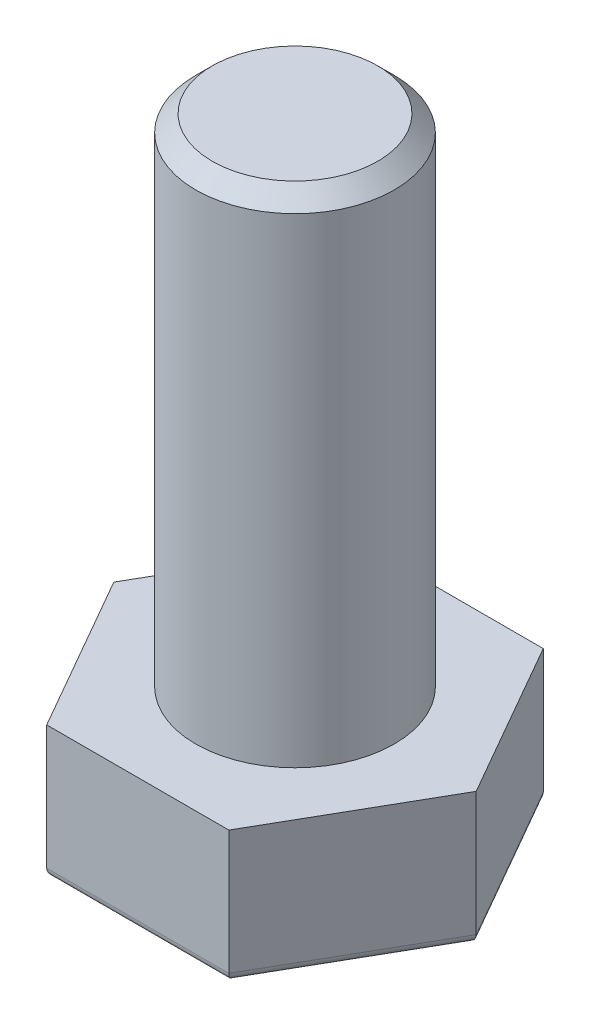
ISO-10303-21;
HEADER;
FILE_DESCRIPTION(('STEP AP214'),'2;1');
FILE_NAME('part.step','',(''),(''),'','','');
FILE_SCHEMA(('AUTOMOTIVE_DESIGN { 1 0 10303 214 1 1 1 1 }'));
ENDSEC;
DATA;
#1=APPLICATION_CONTEXT('core data for automotive mechanical design processes');
#2=APPLICATION_PROTOCOL_DEFINITION('international standard','automotive_design',2000,#1);
#3=PRODUCT_CONTEXT('',#1,'mechanical');
#4=PRODUCT('Part','Part','',(#3));
#5=PRODUCT_RELATED_PRODUCT_CATEGORY('part','',(#4));
#6=PRODUCT_DEFINITION_FORMATION('','',#4);
#7=PRODUCT_DEFINITION_CONTEXT('part definition',#1,'design');
#8=PRODUCT_DEFINITION('design','',#6,#7);
#9=PRODUCT_DEFINITION_SHAPE('','',#8);
#10=(LENGTH_UNIT() NAMED_UNIT(*) SI_UNIT(.MILLI.,.METRE.));
#11=(NAMED_UNIT(*) PLANE_ANGLE_UNIT() SI_UNIT($,.RADIAN.));
#12=(NAMED_UNIT(*) SI_UNIT($,.STERADIAN.) SOLID_ANGLE_UNIT());
#13=UNCERTAINTY_MEASURE_WITH_UNIT(LENGTH_MEASURE(1.E-05),#10,'distance_accuracy_value','');
#14=(GEOMETRIC_REPRESENTATION_CONTEXT(3) GLOBAL_UNCERTAINTY_ASSIGNED_CONTEXT((#13)) GLOBAL_UNIT_ASSIGNED_CONTEXT((#10,
#11,#12)) REPRESENTATION_CONTEXT('',''));
#15=CARTESIAN_POINT('',(0.,0.,0.));
#16=DIRECTION('',(0.,0.,1.));
#17=DIRECTION('',(1.,0.,0.));
#18=AXIS2_PLACEMENT_3D('',#15,#16,#17);
#19=CARTESIAN_POINT('',(5.50458908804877,8.00000000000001,9.4999999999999));
#20=DIRECTION('',(0.,1.,0.));
#21=DIRECTION('',(0.,0.,1.00000000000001));
#22=AXIS2_PLACEMENT_3D('',#19,#20,#21);
#23=PLANE('',#22);
#24=DIRECTION('',(1.00000000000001,0.,0.));
#25=VECTOR('',#24,1.);
#26=CARTESIAN_POINT('',(-5.50458908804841,8.00000000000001,9.4999999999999));
#27=LINE('',#26,#25);
#28=CARTESIAN_POINT('',(-5.50458908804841,8.00000000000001,9.4999999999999));
#29=VERTEX_POINT('',#28);
#30=CARTESIAN_POINT('',(5.50458908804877,8.00000000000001,9.4999999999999));
#31=VERTEX_POINT('',#30);
#32=EDGE_CURVE('E111',#29,#31,#27,.T.);
#33=ORIENTED_EDGE('',*,*,#32,.T.);
#34=DIRECTION('',(0.497297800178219,0.,-0.867579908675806));
#35=VECTOR('',#34,1.);
#36=CARTESIAN_POINT('',(5.50458908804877,8.00000000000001,9.4999999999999));
#37=LINE('',#36,#35);
#38=CARTESIAN_POINT('',(10.9500000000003,8.00000000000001,-1.66533453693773E-13));
#39=VERTEX_POINT('',#38);
#40=EDGE_CURVE('E103',#31,#39,#37,.T.);
#41=ORIENTED_EDGE('',*,*,#40,.T.);
#42=DIRECTION('',(-0.497297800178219,0.,-0.867579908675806));
#43=VECTOR('',#42,1.);
#44=CARTESIAN_POINT('',(5.50458908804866,8.00000000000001,-9.50000000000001));
#45=LINE('',#44,#43);
#46=CARTESIAN_POINT('',(5.50458908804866,8.00000000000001,-9.50000000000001));
#47=VERTEX_POINT('',#46);
#48=EDGE_CURVE('E110',#39,#47,#45,.T.);
#49=ORIENTED_EDGE('',*,*,#48,.T.);
#50=DIRECTION('',(-1.00000000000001,0.,0.));
#51=VECTOR('',#50,1.);
#52=CARTESIAN_POINT('',(-5.50458908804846,8.00000000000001,-9.50000000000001));
#53=LINE('',#52,#51);
#54=CARTESIAN_POINT('',(-5.50458908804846,8.00000000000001,-9.50000000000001));
#55=VERTEX_POINT('',#54);
#56=EDGE_CURVE('E300',#47,#55,#53,.T.);
#57=ORIENTED_EDGE('',*,*,#56,.T.);
#58=DIRECTION('',(-0.49729780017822,0.,0.867579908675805));
#59=VECTOR('',#58,1.);
#60=CARTESIAN_POINT('',(-5.50458908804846,8.00000000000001,-9.50000000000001));
#61=LINE('',#60,#59);
#62=CARTESIAN_POINT('',(-10.95,8.00000000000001,0.));
#63=VERTEX_POINT('',#62);
#64=EDGE_CURVE('E302',#55,#63,#61,.T.);
#65=ORIENTED_EDGE('',*,*,#64,.T.);
#66=DIRECTION('',(0.497297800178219,0.,0.867579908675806));
#67=VECTOR('',#66,1.);
#68=CARTESIAN_POINT('',(-5.50458908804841,8.00000000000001,9.4999999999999));
#69=LINE('',#68,#67);
#70=EDGE_CURVE('E116',#63,#29,#69,.T.);
#71=ORIENTED_EDGE('',*,*,#70,.T.);
#72=EDGE_LOOP('',(#33,#41,#49,#57,#65,#71));
#73=FACE_BOUND('',#72,.T.);
#74=CARTESIAN_POINT('',(2.4980018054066E-13,7.99999999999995,0.));
#75=DIRECTION('',(0.,1.,0.));
#76=DIRECTION('',(0.,0.,1.00000000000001));
#77=AXIS2_PLACEMENT_3D('',#74,#75,#76);
#78=CIRCLE('',#77,6.);
#79=CARTESIAN_POINT('',(2.4980018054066E-13,7.99999999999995,6.00000000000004));
#80=VERTEX_POINT('',#79);
#81=EDGE_CURVE('E281',#80,#80,#78,.T.);
#82=ORIENTED_EDGE('',*,*,#81,.F.);
#83=EDGE_LOOP('',(#82));
#84=FACE_BOUND('',#83,.T.);
#85=ADVANCED_FACE('F32',(#73,#84),#23,.T.);
#86=CARTESIAN_POINT('',(-5.50458908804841,8.00000000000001,9.4999999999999));
#87=DIRECTION('',(0.,0.,-1.00000000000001));
#88=DIRECTION('',(-1.00000000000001,0.,0.));
#89=AXIS2_PLACEMENT_3D('',#86,#87,#88);
#90=PLANE('',#89);
#91=DIRECTION('',(0.,-1.,0.));
#92=VECTOR('',#91,1.);
#93=CARTESIAN_POINT('',(-5.50458908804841,8.00000000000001,9.4999999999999));
#94=LINE('',#93,#92);
#95=CARTESIAN_POINT('',(-5.50458908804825,0.5,9.49999999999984));
#96=VERTEX_POINT('',#95);
#97=EDGE_CURVE('E305',#29,#96,#94,.T.);
#98=ORIENTED_EDGE('',*,*,#97,.T.);
#99=DIRECTION('',(1.00000000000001,0.,0.));
#100=VECTOR('',#99,1.);
#101=CARTESIAN_POINT('',(-5.50458908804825,0.5,9.49999999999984));
#102=LINE('',#101,#100);
#103=CARTESIAN_POINT('',(5.50458908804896,0.5,9.49999999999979));
#104=VERTEX_POINT('',#103);
#105=EDGE_CURVE('E47',#96,#104,#102,.T.);
#106=ORIENTED_EDGE('',*,*,#105,.T.);
#107=DIRECTION('',(0.,-1.,0.));
#108=VECTOR('',#107,1.);
#109=CARTESIAN_POINT('',(5.50458908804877,8.00000000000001,9.4999999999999));
#110=LINE('',#109,#108);
#111=EDGE_CURVE('E106',#31,#104,#110,.T.);
#112=ORIENTED_EDGE('',*,*,#111,.F.);
#113=ORIENTED_EDGE('',*,*,#32,.F.);
#114=EDGE_LOOP('',(#98,#106,#112,#113));
#115=FACE_BOUND('',#114,.T.);
#116=ADVANCED_FACE('F34',(#115),#90,.F.);
#117=CARTESIAN_POINT('',(5.50458908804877,8.00000000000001,9.4999999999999));
#118=DIRECTION('',(-0.867579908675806,0.,-0.497297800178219));
#119=DIRECTION('',(-0.497297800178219,0.,0.867579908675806));
#120=AXIS2_PLACEMENT_3D('',#117,#118,#119);
#121=PLANE('',#120);
#122=ORIENTED_EDGE('',*,*,#111,.T.);
#123=DIRECTION('',(0.497297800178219,0.,-0.867579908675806));
#124=VECTOR('',#123,1.);
#125=CARTESIAN_POINT('',(5.50458908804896,0.5,9.49999999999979));
#126=LINE('',#125,#124);
#127=CARTESIAN_POINT('',(10.9500000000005,0.499999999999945,-1.66533453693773E-13));
#128=VERTEX_POINT('',#127);
#129=EDGE_CURVE('E54',#104,#128,#126,.T.);
#130=ORIENTED_EDGE('',*,*,#129,.T.);
#131=DIRECTION('',(0.,-1.,0.));
#132=VECTOR('',#131,1.);
#133=CARTESIAN_POINT('',(10.9500000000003,8.00000000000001,-1.66533453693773E-13));
#134=LINE('',#133,#132);
#135=EDGE_CURVE('E107',#39,#128,#134,.T.);
#136=ORIENTED_EDGE('',*,*,#135,.F.);
#137=ORIENTED_EDGE('',*,*,#40,.F.);
#138=EDGE_LOOP('',(#122,#130,#136,#137));
#139=FACE_BOUND('',#138,.T.);
#140=ADVANCED_FACE('F105',(#139),#121,.F.);
#141=CARTESIAN_POINT('',(5.50458908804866,8.00000000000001,-9.50000000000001));
#142=DIRECTION('',(-0.867579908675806,0.,0.497297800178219));
#143=DIRECTION('',(0.497297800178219,0.,0.867579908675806));
#144=AXIS2_PLACEMENT_3D('',#141,#142,#143);
#145=PLANE('',#144);
#146=ORIENTED_EDGE('',*,*,#135,.T.);
#147=DIRECTION('',(-0.497297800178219,0.,-0.867579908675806));
#148=VECTOR('',#147,1.);
#149=CARTESIAN_POINT('',(5.50458908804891,0.5,-9.50000000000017));
#150=LINE('',#149,#148);
#151=CARTESIAN_POINT('',(5.50458908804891,0.5,-9.50000000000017));
#152=VERTEX_POINT('',#151);
#153=EDGE_CURVE('E145',#128,#152,#150,.T.);
#154=ORIENTED_EDGE('',*,*,#153,.T.);
#155=DIRECTION('',(0.,-1.,0.));
#156=VECTOR('',#155,1.);
#157=CARTESIAN_POINT('',(5.50458908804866,8.00000000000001,-9.50000000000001));
#158=LINE('',#157,#156);
#159=EDGE_CURVE('E125',#47,#152,#158,.T.);
#160=ORIENTED_EDGE('',*,*,#159,.F.);
#161=ORIENTED_EDGE('',*,*,#48,.F.);
#162=EDGE_LOOP('',(#146,#154,#160,#161));
#163=FACE_BOUND('',#162,.T.);
#164=ADVANCED_FACE('F183',(#163),#145,.F.);
#165=CARTESIAN_POINT('',(-5.50458908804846,8.00000000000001,-9.50000000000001));
#166=DIRECTION('',(0.,0.,1.00000000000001));
#167=DIRECTION('',(1.00000000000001,0.,0.));
#168=AXIS2_PLACEMENT_3D('',#165,#166,#167);
#169=PLANE('',#168);
#170=ORIENTED_EDGE('',*,*,#159,.T.);
#171=DIRECTION('',(-1.00000000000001,0.,0.));
#172=VECTOR('',#171,1.);
#173=CARTESIAN_POINT('',(-5.50458908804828,0.5,-9.50000000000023));
#174=LINE('',#173,#172);
#175=CARTESIAN_POINT('',(-5.50458908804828,0.5,-9.50000000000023));
#176=VERTEX_POINT('',#175);
#177=EDGE_CURVE('E143',#152,#176,#174,.T.);
#178=ORIENTED_EDGE('',*,*,#177,.T.);
#179=DIRECTION('',(0.,-1.,0.));
#180=VECTOR('',#179,1.);
#181=CARTESIAN_POINT('',(-5.50458908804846,8.00000000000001,-9.50000000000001));
#182=LINE('',#181,#180);
#183=EDGE_CURVE('E310',#55,#176,#182,.T.);
#184=ORIENTED_EDGE('',*,*,#183,.F.);
#185=ORIENTED_EDGE('',*,*,#56,.F.);
#186=EDGE_LOOP('',(#170,#178,#184,#185));
#187=FACE_BOUND('',#186,.T.);
#188=ADVANCED_FACE('F179',(#187),#169,.F.);
#189=CARTESIAN_POINT('',(-5.50458908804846,8.00000000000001,-9.50000000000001));
#190=DIRECTION('',(0.867579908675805,0.,0.49729780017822));
#191=DIRECTION('',(0.49729780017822,0.,-0.867579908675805));
#192=AXIS2_PLACEMENT_3D('',#189,#190,#191);
#193=PLANE('',#192);
#194=ORIENTED_EDGE('',*,*,#183,.T.);
#195=DIRECTION('',(-0.49729780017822,0.,0.867579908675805));
#196=VECTOR('',#195,1.);
#197=CARTESIAN_POINT('',(-5.50458908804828,0.5,-9.50000000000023));
#198=LINE('',#197,#196);
#199=CARTESIAN_POINT('',(-10.9500000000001,0.5,0.));
#200=VERTEX_POINT('',#199);
#201=EDGE_CURVE('E141',#176,#200,#198,.T.);
#202=ORIENTED_EDGE('',*,*,#201,.T.);
#203=DIRECTION('',(0.,-1.,0.));
#204=VECTOR('',#203,1.);
#205=CARTESIAN_POINT('',(-10.95,8.00000000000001,0.));
#206=LINE('',#205,#204);
#207=EDGE_CURVE('E307',#63,#200,#206,.T.);
#208=ORIENTED_EDGE('',*,*,#207,.F.);
#209=ORIENTED_EDGE('',*,*,#64,.F.);
#210=EDGE_LOOP('',(#194,#202,#208,#209));
#211=FACE_BOUND('',#210,.T.);
#212=ADVANCED_FACE('F175',(#211),#193,.F.);
#213=CARTESIAN_POINT('',(-5.50458908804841,8.00000000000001,9.4999999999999));
#214=DIRECTION('',(0.867579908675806,0.,-0.497297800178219));
#215=DIRECTION('',(-0.497297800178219,0.,-0.867579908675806));
#216=AXIS2_PLACEMENT_3D('',#213,#214,#215);
#217=PLANE('',#216);
#218=ORIENTED_EDGE('',*,*,#207,.T.);
#219=DIRECTION('',(0.497297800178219,0.,0.867579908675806));
#220=VECTOR('',#219,1.);
#221=CARTESIAN_POINT('',(-5.50458908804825,0.5,9.49999999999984));
#222=LINE('',#221,#220);
#223=EDGE_CURVE('E120',#200,#96,#222,.T.);
#224=ORIENTED_EDGE('',*,*,#223,.T.);
#225=ORIENTED_EDGE('',*,*,#97,.F.);
#226=ORIENTED_EDGE('',*,*,#70,.F.);
#227=EDGE_LOOP('',(#218,#224,#225,#226));
#228=FACE_BOUND('',#227,.T.);
#229=ADVANCED_FACE('F172',(#228),#217,.F.);
#230=CARTESIAN_POINT('',(5.50458908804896,0.,9.49999999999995));
#231=DIRECTION('',(0.,1.,0.));
#232=DIRECTION('',(0.,0.,1.00000000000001));
#233=AXIS2_PLACEMENT_3D('',#230,#231,#232);
#234=PLANE('',#233);
#235=DIRECTION('',(1.00000000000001,0.,0.));
#236=VECTOR('',#235,1.);
#237=CARTESIAN_POINT('',(5.50458908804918,0.,8.99999999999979));
#238=LINE('',#237,#236);
#239=CARTESIAN_POINT('',(5.21487387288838,0.,8.9999999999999));
#240=VERTEX_POINT('',#239);
#241=CARTESIAN_POINT('',(-5.21487387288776,0.,9.00000000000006));
#242=VERTEX_POINT('',#241);
#243=EDGE_CURVE('E123',#240,#242,#238,.F.);
#244=ORIENTED_EDGE('',*,*,#243,.T.);
#245=DIRECTION('',(0.497297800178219,0.,0.867579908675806));
#246=VECTOR('',#245,1.);
#247=CARTESIAN_POINT('',(-2.34817320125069,0.,14.0012123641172));
#248=LINE('',#247,#246);
#249=CARTESIAN_POINT('',(-10.3736842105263,0.,-2.77555756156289E-13));
#250=VERTEX_POINT('',#249);
#251=EDGE_CURVE('E138',#242,#250,#248,.F.);
#252=ORIENTED_EDGE('',*,*,#251,.T.);
#253=DIRECTION('',(-0.49729780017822,0.,0.867579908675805));
#254=VECTOR('',#253,1.);
#255=CARTESIAN_POINT('',(-10.5456392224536,0.,0.299990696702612));
#256=LINE('',#255,#254);
#257=CARTESIAN_POINT('',(-5.21487387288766,0.,-9.00000000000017));
#258=VERTEX_POINT('',#257);
#259=EDGE_CURVE('E136',#250,#258,#256,.F.);
#260=ORIENTED_EDGE('',*,*,#259,.T.);
#261=DIRECTION('',(-1.00000000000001,0.,0.));
#262=VECTOR('',#261,1.);
#263=CARTESIAN_POINT('',(5.50458908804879,0.,-9.00000000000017));
#264=LINE('',#263,#262);
#265=CARTESIAN_POINT('',(5.21487387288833,0.,-9.00000000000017));
#266=VERTEX_POINT('',#265);
#267=EDGE_CURVE('E134',#258,#266,#264,.F.);
#268=ORIENTED_EDGE('',*,*,#267,.T.);
#269=DIRECTION('',(-0.497297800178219,0.,-0.867579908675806));
#270=VECTOR('',#269,1.);
#271=CARTESIAN_POINT('',(13.2682651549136,0.,5.04985196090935));
#272=LINE('',#271,#270);
#273=CARTESIAN_POINT('',(10.3736842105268,0.,-3.33066907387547E-13));
#274=VERTEX_POINT('',#273);
#275=EDGE_CURVE('E132',#266,#274,#272,.F.);
#276=ORIENTED_EDGE('',*,*,#275,.T.);
#277=DIRECTION('',(0.497297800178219,0.,-0.867579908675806));
#278=VECTOR('',#277,1.);
#279=CARTESIAN_POINT('',(5.070799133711,0.,9.25135109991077));
#280=LINE('',#279,#278);
#281=EDGE_CURVE('E130',#274,#240,#280,.F.);
#282=ORIENTED_EDGE('',*,*,#281,.T.);
#283=EDGE_LOOP('',(#244,#252,#260,#268,#276,#282));
#284=FACE_BOUND('',#283,.T.);
#285=ADVANCED_FACE('F170',(#284),#234,.F.);
#286=CARTESIAN_POINT('',(5.07079913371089,0.5,-9.2513510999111));
#287=DIRECTION('',(-0.497297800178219,0.,-0.867579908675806));
#288=DIRECTION('',(-0.867579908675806,0.,0.497297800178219));
#289=AXIS2_PLACEMENT_3D('',#286,#287,#288);
#290=CYLINDRICAL_SURFACE('',#289,0.5);
#291=CARTESIAN_POINT('',(10.3736842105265,0.5,0.));
#292=DIRECTION('',(0.,0.,-1.00000000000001));
#293=DIRECTION('',(1.00000000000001,0.,0.));
#294=AXIS2_PLACEMENT_3D('',#291,#292,#293);
#295=ELLIPSE('',#294,0.576315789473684,0.5);
#296=EDGE_CURVE('E294',#274,#128,#295,.F.);
#297=ORIENTED_EDGE('',*,*,#296,.F.);
#298=ORIENTED_EDGE('',*,*,#275,.F.);
#299=CARTESIAN_POINT('',(5.21487387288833,0.5,-9.00000000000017));
#300=DIRECTION('',(-0.865244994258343,0.,-0.501349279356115));
#301=DIRECTION('',(0.501349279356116,0.,-0.865244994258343));
#302=AXIS2_PLACEMENT_3D('',#299,#300,#301);
#303=ELLIPSE('',#302,0.57787101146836,0.5);
#304=EDGE_CURVE('E118',#152,#266,#303,.T.);
#305=ORIENTED_EDGE('',*,*,#304,.F.);
#306=ORIENTED_EDGE('',*,*,#153,.F.);
#307=EDGE_LOOP('',(#297,#298,#305,#306));
#308=FACE_BOUND('',#307,.T.);
#309=ADVANCED_FACE('F214',(#308),#290,.T.);
#310=CARTESIAN_POINT('',(-5.50458908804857,0.5,-9.00000000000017));
#311=DIRECTION('',(-1.00000000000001,0.,0.));
#312=DIRECTION('',(0.,0.,1.00000000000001));
#313=AXIS2_PLACEMENT_3D('',#310,#311,#312);
#314=CYLINDRICAL_SURFACE('',#313,0.5);
#315=ORIENTED_EDGE('',*,*,#304,.T.);
#316=ORIENTED_EDGE('',*,*,#267,.F.);
#317=CARTESIAN_POINT('',(-5.21487387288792,0.5,-9.00000000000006));
#318=DIRECTION('',(-0.865244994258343,0.,0.501349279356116));
#319=DIRECTION('',(-0.501349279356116,0.,-0.865244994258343));
#320=AXIS2_PLACEMENT_3D('',#317,#318,#319);
#321=ELLIPSE('',#320,0.57787101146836,0.5);
#322=EDGE_CURVE('E291',#176,#258,#321,.T.);
#323=ORIENTED_EDGE('',*,*,#322,.F.);
#324=ORIENTED_EDGE('',*,*,#177,.F.);
#325=EDGE_LOOP('',(#315,#316,#323,#324));
#326=FACE_BOUND('',#325,.T.);
#327=ADVANCED_FACE('F221',(#326),#314,.T.);
#328=CARTESIAN_POINT('',(5.07079913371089,0.5,9.2513510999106));
#329=DIRECTION('',(0.497297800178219,0.,-0.867579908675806));
#330=DIRECTION('',(-0.867579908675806,0.,-0.497297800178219));
#331=AXIS2_PLACEMENT_3D('',#328,#329,#330);
#332=CYLINDRICAL_SURFACE('',#331,0.5);
#333=ORIENTED_EDGE('',*,*,#296,.T.);
#334=ORIENTED_EDGE('',*,*,#129,.F.);
#335=CARTESIAN_POINT('',(5.21487387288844,0.5,8.99999999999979));
#336=DIRECTION('',(0.865244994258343,0.,-0.501349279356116));
#337=DIRECTION('',(0.501349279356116,0.,0.865244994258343));
#338=AXIS2_PLACEMENT_3D('',#335,#336,#337);
#339=ELLIPSE('',#338,0.57787101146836,0.5);
#340=EDGE_CURVE('E288',#240,#104,#339,.F.);
#341=ORIENTED_EDGE('',*,*,#340,.F.);
#342=ORIENTED_EDGE('',*,*,#281,.F.);
#343=EDGE_LOOP('',(#333,#334,#341,#342));
#344=FACE_BOUND('',#343,.T.);
#345=ADVANCED_FACE('F228',(#344),#332,.T.);
#346=CARTESIAN_POINT('',(-5.07079913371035,0.5,-9.2513510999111));
#347=DIRECTION('',(-0.49729780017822,0.,0.867579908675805));
#348=DIRECTION('',(0.867579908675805,0.,0.49729780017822));
#349=AXIS2_PLACEMENT_3D('',#346,#347,#348);
#350=CYLINDRICAL_SURFACE('',#349,0.5);
#351=ORIENTED_EDGE('',*,*,#322,.T.);
#352=ORIENTED_EDGE('',*,*,#259,.F.);
#353=CARTESIAN_POINT('',(-10.3736842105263,0.5,-2.22044604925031E-13));
#354=DIRECTION('',(0.,0.,1.00000000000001));
#355=DIRECTION('',(-1.00000000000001,0.,0.));
#356=AXIS2_PLACEMENT_3D('',#353,#354,#355);
#357=ELLIPSE('',#356,0.576315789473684,0.5);
#358=EDGE_CURVE('E284',#200,#250,#357,.T.);
#359=ORIENTED_EDGE('',*,*,#358,.F.);
#360=ORIENTED_EDGE('',*,*,#201,.F.);
#361=EDGE_LOOP('',(#351,#352,#359,#360));
#362=FACE_BOUND('',#361,.T.);
#363=ADVANCED_FACE('F236',(#362),#350,.T.);
#364=CARTESIAN_POINT('',(-5.50458908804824,0.5,8.99999999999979));
#365=DIRECTION('',(1.00000000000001,0.,0.));
#366=DIRECTION('',(0.,0.,-1.00000000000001));
#367=AXIS2_PLACEMENT_3D('',#364,#365,#366);
#368=CYLINDRICAL_SURFACE('',#367,0.5);
#369=ORIENTED_EDGE('',*,*,#340,.T.);
#370=ORIENTED_EDGE('',*,*,#105,.F.);
#371=CARTESIAN_POINT('',(-5.21487387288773,0.5,8.99999999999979));
#372=DIRECTION('',(0.865244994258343,0.,0.501349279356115));
#373=DIRECTION('',(0.501349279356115,0.,-0.865244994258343));
#374=AXIS2_PLACEMENT_3D('',#371,#372,#373);
#375=ELLIPSE('',#374,0.57787101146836,0.5);
#376=EDGE_CURVE('E282',#242,#96,#375,.F.);
#377=ORIENTED_EDGE('',*,*,#376,.F.);
#378=ORIENTED_EDGE('',*,*,#243,.F.);
#379=EDGE_LOOP('',(#369,#370,#377,#378));
#380=FACE_BOUND('',#379,.T.);
#381=ADVANCED_FACE('F244',(#380),#368,.T.);
#382=CARTESIAN_POINT('',(-5.07079913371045,0.5,9.25135109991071));
#383=DIRECTION('',(0.497297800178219,0.,0.867579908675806));
#384=DIRECTION('',(0.867579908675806,0.,-0.497297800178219));
#385=AXIS2_PLACEMENT_3D('',#382,#383,#384);
#386=CYLINDRICAL_SURFACE('',#385,0.5);
#387=ORIENTED_EDGE('',*,*,#358,.T.);
#388=ORIENTED_EDGE('',*,*,#251,.F.);
#389=ORIENTED_EDGE('',*,*,#376,.T.);
#390=ORIENTED_EDGE('',*,*,#223,.F.);
#391=EDGE_LOOP('',(#387,#388,#389,#390));
#392=FACE_BOUND('',#391,.T.);
#393=ADVANCED_FACE('F252',(#392),#386,.T.);
#394=CARTESIAN_POINT('',(0.,38.,-1.66533453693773E-13));
#395=DIRECTION('',(0.,-1.,0.));
#396=DIRECTION('',(0.,0.,-1.00000000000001));
#397=AXIS2_PLACEMENT_3D('',#394,#395,#396);
#398=CYLINDRICAL_SURFACE('',#397,6.);
#399=CARTESIAN_POINT('',(1.38777878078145E-13,37.,-2.77555756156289E-13));
#400=DIRECTION('',(0.,1.,0.));
#401=DIRECTION('',(0.,0.,1.00000000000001));
#402=AXIS2_PLACEMENT_3D('',#399,#400,#401);
#403=CIRCLE('',#402,6.);
#404=CARTESIAN_POINT('',(1.38777878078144E-13,37.,5.99999999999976));
#405=VERTEX_POINT('',#404);
#406=EDGE_CURVE('E11',#405,#405,#403,.F.);
#407=ORIENTED_EDGE('',*,*,#406,.T.);
#408=EDGE_LOOP('',(#407));
#409=FACE_BOUND('',#408,.T.);
#410=ORIENTED_EDGE('',*,*,#81,.T.);
#411=EDGE_LOOP('',(#410));
#412=FACE_BOUND('',#411,.T.);
#413=ADVANCED_FACE('F160',(#409,#412),#398,.T.);
#414=CARTESIAN_POINT('',(0.,38.,-1.66533453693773E-13));
#415=DIRECTION('',(0.,1.,0.));
#416=DIRECTION('',(0.,0.,1.00000000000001));
#417=AXIS2_PLACEMENT_3D('',#414,#415,#416);
#418=PLANE('',#417);
#419=CARTESIAN_POINT('',(0.,38.,-1.66533453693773E-13));
#420=DIRECTION('',(0.,1.,0.));
#421=DIRECTION('',(0.,0.,1.00000000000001));
#422=AXIS2_PLACEMENT_3D('',#419,#420,#421);
#423=CIRCLE('',#422,5.);
#424=CARTESIAN_POINT('',(0.,38.,4.99999999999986));
#425=VERTEX_POINT('',#424);
#426=EDGE_CURVE('E40',#425,#425,#423,.T.);
#427=ORIENTED_EDGE('',*,*,#426,.T.);
#428=EDGE_LOOP('',(#427));
#429=FACE_BOUND('',#428,.T.);
#430=ADVANCED_FACE('F151',(#429),#418,.T.);
#431=CARTESIAN_POINT('',(0.,38.,-1.66533453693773E-13));
#432=DIRECTION('',(0.,-1.,0.));
#433=DIRECTION('',(0.,0.,-1.00000000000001));
#434=AXIS2_PLACEMENT_3D('',#431,#432,#433);
#435=CONICAL_SURFACE('',#434,5.,0.785398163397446);
#436=ORIENTED_EDGE('',*,*,#406,.F.);
#437=EDGE_LOOP('',(#436));
#438=FACE_BOUND('',#437,.T.);
#439=ORIENTED_EDGE('',*,*,#426,.F.);
#440=EDGE_LOOP('',(#439));
#441=FACE_BOUND('',#440,.T.);
#442=ADVANCED_FACE('F153',(#438,#441),#435,.T.);
#443=CLOSED_SHELL('',(#85,#116,#140,#164,#188,#212,#229,#285,#309,#327,#345,#363,#381,#393,#413,
#430,#442));
#444=MANIFOLD_SOLID_BREP('B2',#443);
#445=ADVANCED_BREP_SHAPE_REPRESENTATION('',(#18,#444),#14);
#446=SHAPE_DEFINITION_REPRESENTATION(#9,#445);
ENDSEC;
END-ISO-10303-21;
